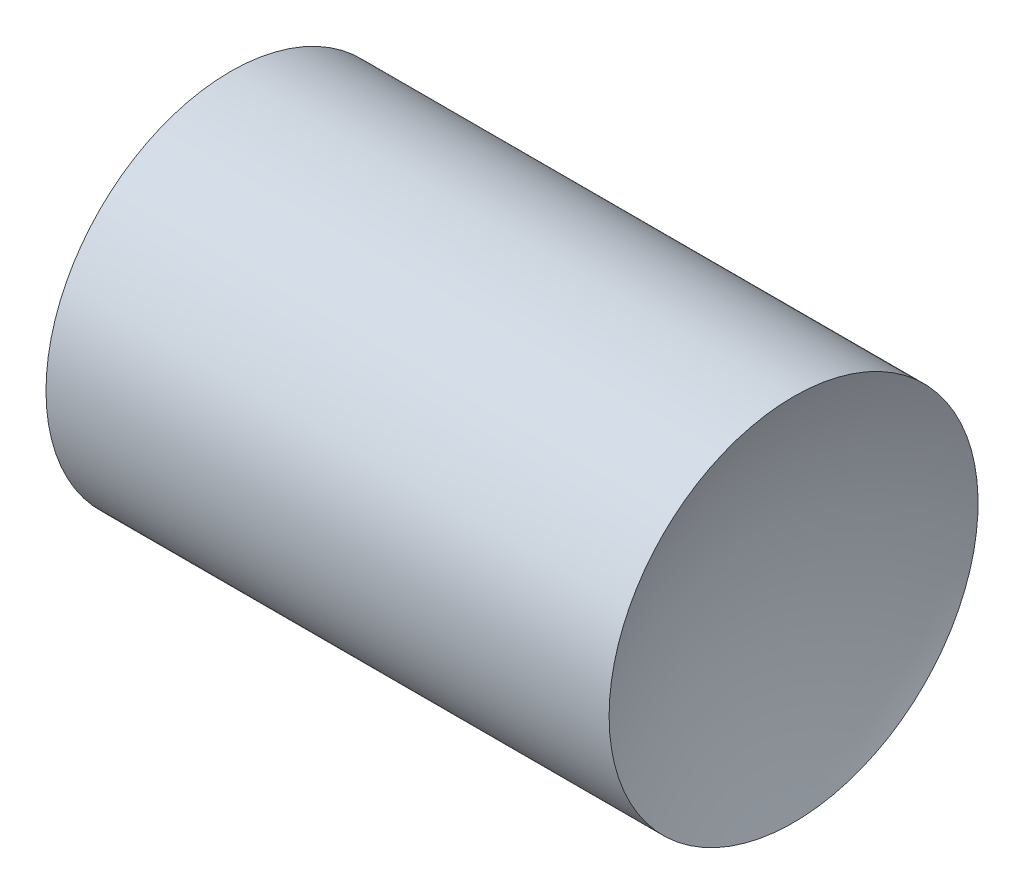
from build123d import *


with BuildPart() as part:
    # Skizze1 → Rotation1 (revolve)
    with BuildSketch(Plane.XY.offset(8)):
        with BuildLine():
            Line((11.744658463, 2.5), (19.375444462, 2.5))
            ThreePointArc((19.375444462, 2.5), (18.971653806, 1.278874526), (18.835, 0))
            Line((18.835, 0), (11.48, 0))
            ThreePointArc((11.48, 0), (11.546348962, 1.256984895), (11.744658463, 2.5))
        make_face()
    revolve(axis=Axis((0, 0, 8), (1, 0, 0)))


solid = part.part
